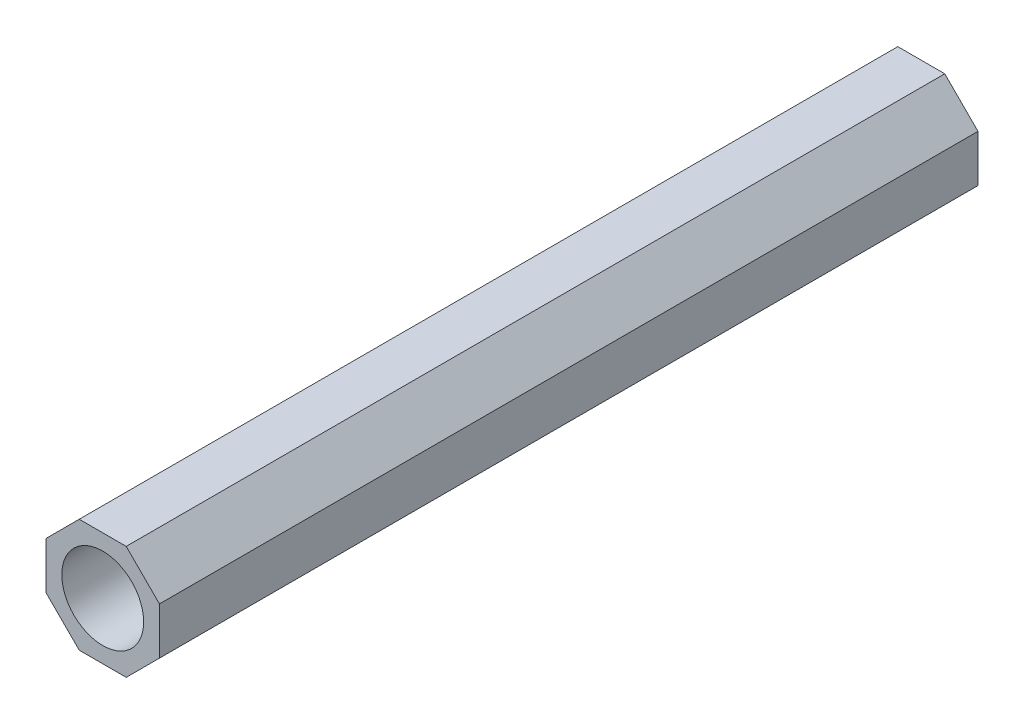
ISO-10303-21;
HEADER;
FILE_DESCRIPTION(('STEP AP214'),'2;1');
FILE_NAME('part.step','',(''),(''),'','','');
FILE_SCHEMA(('AUTOMOTIVE_DESIGN { 1 0 10303 214 1 1 1 1 }'));
ENDSEC;
DATA;
#1=APPLICATION_CONTEXT('core data for automotive mechanical design processes');
#2=APPLICATION_PROTOCOL_DEFINITION('international standard','automotive_design',2000,#1);
#3=PRODUCT_CONTEXT('',#1,'mechanical');
#4=PRODUCT('Part','Part','',(#3));
#5=PRODUCT_RELATED_PRODUCT_CATEGORY('part','',(#4));
#6=PRODUCT_DEFINITION_FORMATION('','',#4);
#7=PRODUCT_DEFINITION_CONTEXT('part definition',#1,'design');
#8=PRODUCT_DEFINITION('design','',#6,#7);
#9=PRODUCT_DEFINITION_SHAPE('','',#8);
#10=(LENGTH_UNIT() NAMED_UNIT(*) SI_UNIT(.MILLI.,.METRE.));
#11=(NAMED_UNIT(*) PLANE_ANGLE_UNIT() SI_UNIT($,.RADIAN.));
#12=(NAMED_UNIT(*) SI_UNIT($,.STERADIAN.) SOLID_ANGLE_UNIT());
#13=UNCERTAINTY_MEASURE_WITH_UNIT(LENGTH_MEASURE(1.E-05),#10,'distance_accuracy_value','');
#14=(GEOMETRIC_REPRESENTATION_CONTEXT(3) GLOBAL_UNCERTAINTY_ASSIGNED_CONTEXT((#13)) GLOBAL_UNIT_ASSIGNED_CONTEXT((#10,
#11,#12)) REPRESENTATION_CONTEXT('',''));
#15=CARTESIAN_POINT('',(0.,0.,0.));
#16=DIRECTION('',(0.,0.,1.));
#17=DIRECTION('',(1.,0.,0.));
#18=AXIS2_PLACEMENT_3D('',#15,#16,#17);
#19=CARTESIAN_POINT('',(-296.00004745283,3.6450596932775,127.));
#20=DIRECTION('',(-0.707106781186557,-0.707106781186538,0.));
#21=DIRECTION('',(0.707106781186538,-0.707106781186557,0.));
#22=AXIS2_PLACEMENT_3D('',#19,#20,#21);
#23=PLANE('',#22);
#24=DIRECTION('',(-0.707106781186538,0.707106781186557,0.));
#25=VECTOR('',#24,1.);
#26=CARTESIAN_POINT('',(-296.00004745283,3.6450596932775,0.));
#27=LINE('',#26,#25);
#28=CARTESIAN_POINT('',(-296.00004745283,3.6450596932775,0.));
#29=VERTEX_POINT('',#28);
#30=CARTESIAN_POINT('',(-301.154940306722,8.79995254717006,0.));
#31=VERTEX_POINT('',#30);
#32=EDGE_CURVE('E129',#29,#31,#27,.T.);
#33=ORIENTED_EDGE('',*,*,#32,.T.);
#34=DIRECTION('',(0.,0.,-1.));
#35=VECTOR('',#34,1.);
#36=CARTESIAN_POINT('',(-301.154940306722,8.79995254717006,127.));
#37=LINE('',#36,#35);
#38=CARTESIAN_POINT('',(-301.154940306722,8.79995254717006,127.));
#39=VERTEX_POINT('',#38);
#40=EDGE_CURVE('E11',#39,#31,#37,.T.);
#41=ORIENTED_EDGE('',*,*,#40,.F.);
#42=DIRECTION('',(-0.707106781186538,0.707106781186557,0.));
#43=VECTOR('',#42,1.);
#44=CARTESIAN_POINT('',(-296.00004745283,3.6450596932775,127.));
#45=LINE('',#44,#43);
#46=CARTESIAN_POINT('',(-296.00004745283,3.6450596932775,127.));
#47=VERTEX_POINT('',#46);
#48=EDGE_CURVE('E144',#47,#39,#45,.T.);
#49=ORIENTED_EDGE('',*,*,#48,.F.);
#50=DIRECTION('',(0.,0.,-1.));
#51=VECTOR('',#50,1.);
#52=CARTESIAN_POINT('',(-296.00004745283,3.6450596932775,127.));
#53=LINE('',#52,#51);
#54=EDGE_CURVE('E125',#47,#29,#53,.T.);
#55=ORIENTED_EDGE('',*,*,#54,.T.);
#56=EDGE_LOOP('',(#33,#41,#49,#55));
#57=FACE_BOUND('',#56,.T.);
#58=ADVANCED_FACE('F33',(#57),#23,.F.);
#59=CARTESIAN_POINT('',(-301.154940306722,8.79995254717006,127.));
#60=DIRECTION('',(0.,-1.,0.));
#61=DIRECTION('',(1.,0.,0.));
#62=AXIS2_PLACEMENT_3D('',#59,#60,#61);
#63=PLANE('',#62);
#64=DIRECTION('',(-1.,0.,0.));
#65=VECTOR('',#64,1.);
#66=CARTESIAN_POINT('',(-301.154940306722,8.79995254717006,0.));
#67=LINE('',#66,#65);
#68=CARTESIAN_POINT('',(-308.445059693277,8.79995254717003,0.));
#69=VERTEX_POINT('',#68);
#70=EDGE_CURVE('E132',#31,#69,#67,.T.);
#71=ORIENTED_EDGE('',*,*,#70,.T.);
#72=DIRECTION('',(0.,0.,-1.));
#73=VECTOR('',#72,1.);
#74=CARTESIAN_POINT('',(-308.445059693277,8.79995254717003,127.));
#75=LINE('',#74,#73);
#76=CARTESIAN_POINT('',(-308.445059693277,8.79995254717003,127.));
#77=VERTEX_POINT('',#76);
#78=EDGE_CURVE('E41',#77,#69,#75,.T.);
#79=ORIENTED_EDGE('',*,*,#78,.F.);
#80=DIRECTION('',(-1.,0.,0.));
#81=VECTOR('',#80,1.);
#82=CARTESIAN_POINT('',(-301.154940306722,8.79995254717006,127.));
#83=LINE('',#82,#81);
#84=EDGE_CURVE('E92',#39,#77,#83,.T.);
#85=ORIENTED_EDGE('',*,*,#84,.F.);
#86=ORIENTED_EDGE('',*,*,#40,.T.);
#87=EDGE_LOOP('',(#71,#79,#85,#86));
#88=FACE_BOUND('',#87,.T.);
#89=ADVANCED_FACE('F200',(#88),#63,.F.);
#90=CARTESIAN_POINT('',(-308.445059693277,8.79995254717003,127.));
#91=DIRECTION('',(0.707106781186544,-0.707106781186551,0.));
#92=DIRECTION('',(0.707106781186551,0.707106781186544,0.));
#93=AXIS2_PLACEMENT_3D('',#90,#91,#92);
#94=PLANE('',#93);
#95=DIRECTION('',(-0.707106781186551,-0.707106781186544,0.));
#96=VECTOR('',#95,1.);
#97=CARTESIAN_POINT('',(-308.445059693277,8.79995254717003,0.));
#98=LINE('',#97,#96);
#99=CARTESIAN_POINT('',(-313.59995254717,3.6450596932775,0.));
#100=VERTEX_POINT('',#99);
#101=EDGE_CURVE('E135',#69,#100,#98,.T.);
#102=ORIENTED_EDGE('',*,*,#101,.T.);
#103=DIRECTION('',(0.,0.,-1.));
#104=VECTOR('',#103,1.);
#105=CARTESIAN_POINT('',(-313.59995254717,3.6450596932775,127.));
#106=LINE('',#105,#104);
#107=CARTESIAN_POINT('',(-313.59995254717,3.6450596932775,127.));
#108=VERTEX_POINT('',#107);
#109=EDGE_CURVE('E151',#108,#100,#106,.T.);
#110=ORIENTED_EDGE('',*,*,#109,.F.);
#111=DIRECTION('',(-0.707106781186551,-0.707106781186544,0.));
#112=VECTOR('',#111,1.);
#113=CARTESIAN_POINT('',(-308.445059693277,8.79995254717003,127.));
#114=LINE('',#113,#112);
#115=EDGE_CURVE('E159',#77,#108,#114,.T.);
#116=ORIENTED_EDGE('',*,*,#115,.F.);
#117=ORIENTED_EDGE('',*,*,#78,.T.);
#118=EDGE_LOOP('',(#102,#110,#116,#117));
#119=FACE_BOUND('',#118,.T.);
#120=ADVANCED_FACE('F157',(#119),#94,.F.);
#121=CARTESIAN_POINT('',(-313.59995254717,3.6450596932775,127.));
#122=DIRECTION('',(1.,0.,0.));
#123=DIRECTION('',(0.,0.,-1.));
#124=AXIS2_PLACEMENT_3D('',#121,#122,#123);
#125=PLANE('',#124);
#126=DIRECTION('',(0.,-1.,0.));
#127=VECTOR('',#126,1.);
#128=CARTESIAN_POINT('',(-313.59995254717,3.6450596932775,0.));
#129=LINE('',#128,#127);
#130=CARTESIAN_POINT('',(-313.59995254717,-3.64505969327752,0.));
#131=VERTEX_POINT('',#130);
#132=EDGE_CURVE('E137',#100,#131,#129,.T.);
#133=ORIENTED_EDGE('',*,*,#132,.T.);
#134=DIRECTION('',(0.,0.,-1.));
#135=VECTOR('',#134,1.);
#136=CARTESIAN_POINT('',(-313.59995254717,-3.64505969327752,127.));
#137=LINE('',#136,#135);
#138=CARTESIAN_POINT('',(-313.59995254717,-3.64505969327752,127.));
#139=VERTEX_POINT('',#138);
#140=EDGE_CURVE('E148',#139,#131,#137,.T.);
#141=ORIENTED_EDGE('',*,*,#140,.F.);
#142=DIRECTION('',(0.,-1.,0.));
#143=VECTOR('',#142,1.);
#144=CARTESIAN_POINT('',(-313.59995254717,3.6450596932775,127.));
#145=LINE('',#144,#143);
#146=EDGE_CURVE('E171',#108,#139,#145,.T.);
#147=ORIENTED_EDGE('',*,*,#146,.F.);
#148=ORIENTED_EDGE('',*,*,#109,.T.);
#149=EDGE_LOOP('',(#133,#141,#147,#148));
#150=FACE_BOUND('',#149,.T.);
#151=ADVANCED_FACE('F167',(#150),#125,.F.);
#152=CARTESIAN_POINT('',(-313.59995254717,-3.64505969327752,127.));
#153=DIRECTION('',(0.707106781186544,0.707106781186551,0.));
#154=DIRECTION('',(-0.707106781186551,0.707106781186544,0.));
#155=AXIS2_PLACEMENT_3D('',#152,#153,#154);
#156=PLANE('',#155);
#157=DIRECTION('',(0.707106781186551,-0.707106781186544,0.));
#158=VECTOR('',#157,1.);
#159=CARTESIAN_POINT('',(-313.59995254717,-3.64505969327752,0.));
#160=LINE('',#159,#158);
#161=CARTESIAN_POINT('',(-308.445059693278,-8.79995254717,0.));
#162=VERTEX_POINT('',#161);
#163=EDGE_CURVE('E139',#131,#162,#160,.T.);
#164=ORIENTED_EDGE('',*,*,#163,.T.);
#165=DIRECTION('',(0.,0.,-1.));
#166=VECTOR('',#165,1.);
#167=CARTESIAN_POINT('',(-308.445059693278,-8.79995254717,127.));
#168=LINE('',#167,#166);
#169=CARTESIAN_POINT('',(-308.445059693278,-8.79995254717,127.));
#170=VERTEX_POINT('',#169);
#171=EDGE_CURVE('E120',#170,#162,#168,.T.);
#172=ORIENTED_EDGE('',*,*,#171,.F.);
#173=DIRECTION('',(0.707106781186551,-0.707106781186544,0.));
#174=VECTOR('',#173,1.);
#175=CARTESIAN_POINT('',(-313.59995254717,-3.64505969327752,127.));
#176=LINE('',#175,#174);
#177=EDGE_CURVE('E111',#139,#170,#176,.T.);
#178=ORIENTED_EDGE('',*,*,#177,.F.);
#179=ORIENTED_EDGE('',*,*,#140,.T.);
#180=EDGE_LOOP('',(#164,#172,#178,#179));
#181=FACE_BOUND('',#180,.T.);
#182=ADVANCED_FACE('F170',(#181),#156,.F.);
#183=CARTESIAN_POINT('',(-308.445059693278,-8.79995254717,127.));
#184=DIRECTION('',(0.,1.,0.));
#185=DIRECTION('',(-1.,0.,0.));
#186=AXIS2_PLACEMENT_3D('',#183,#184,#185);
#187=PLANE('',#186);
#188=DIRECTION('',(1.,0.,0.));
#189=VECTOR('',#188,1.);
#190=CARTESIAN_POINT('',(-308.445059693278,-8.79995254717,0.));
#191=LINE('',#190,#189);
#192=CARTESIAN_POINT('',(-301.154940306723,-8.79995254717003,0.));
#193=VERTEX_POINT('',#192);
#194=EDGE_CURVE('E119',#162,#193,#191,.T.);
#195=ORIENTED_EDGE('',*,*,#194,.T.);
#196=DIRECTION('',(0.,0.,-1.));
#197=VECTOR('',#196,1.);
#198=CARTESIAN_POINT('',(-301.154940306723,-8.79995254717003,127.));
#199=LINE('',#198,#197);
#200=CARTESIAN_POINT('',(-301.154940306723,-8.79995254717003,127.));
#201=VERTEX_POINT('',#200);
#202=EDGE_CURVE('E116',#201,#193,#199,.T.);
#203=ORIENTED_EDGE('',*,*,#202,.F.);
#204=DIRECTION('',(1.,0.,0.));
#205=VECTOR('',#204,1.);
#206=CARTESIAN_POINT('',(-308.445059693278,-8.79995254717,127.));
#207=LINE('',#206,#205);
#208=EDGE_CURVE('E105',#170,#201,#207,.T.);
#209=ORIENTED_EDGE('',*,*,#208,.F.);
#210=ORIENTED_EDGE('',*,*,#171,.T.);
#211=EDGE_LOOP('',(#195,#203,#209,#210));
#212=FACE_BOUND('',#211,.T.);
#213=ADVANCED_FACE('F117',(#212),#187,.F.);
#214=CARTESIAN_POINT('',(-301.154940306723,-8.79995254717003,127.));
#215=DIRECTION('',(-0.707106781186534,0.707106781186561,0.));
#216=DIRECTION('',(-0.707106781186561,-0.707106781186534,0.));
#217=AXIS2_PLACEMENT_3D('',#214,#215,#216);
#218=PLANE('',#217);
#219=DIRECTION('',(0.707106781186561,0.707106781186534,0.));
#220=VECTOR('',#219,1.);
#221=CARTESIAN_POINT('',(-301.154940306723,-8.79995254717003,0.));
#222=LINE('',#221,#220);
#223=CARTESIAN_POINT('',(-296.00004745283,-3.64505969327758,0.));
#224=VERTEX_POINT('',#223);
#225=EDGE_CURVE('E78',#193,#224,#222,.T.);
#226=ORIENTED_EDGE('',*,*,#225,.T.);
#227=DIRECTION('',(0.,0.,-1.));
#228=VECTOR('',#227,1.);
#229=CARTESIAN_POINT('',(-296.00004745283,-3.64505969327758,127.));
#230=LINE('',#229,#228);
#231=CARTESIAN_POINT('',(-296.00004745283,-3.64505969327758,127.));
#232=VERTEX_POINT('',#231);
#233=EDGE_CURVE('E121',#232,#224,#230,.T.);
#234=ORIENTED_EDGE('',*,*,#233,.F.);
#235=DIRECTION('',(0.707106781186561,0.707106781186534,0.));
#236=VECTOR('',#235,1.);
#237=CARTESIAN_POINT('',(-301.154940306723,-8.79995254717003,127.));
#238=LINE('',#237,#236);
#239=EDGE_CURVE('E109',#201,#232,#238,.T.);
#240=ORIENTED_EDGE('',*,*,#239,.F.);
#241=ORIENTED_EDGE('',*,*,#202,.T.);
#242=EDGE_LOOP('',(#226,#234,#240,#241));
#243=FACE_BOUND('',#242,.T.);
#244=ADVANCED_FACE('F123',(#243),#218,.F.);
#245=CARTESIAN_POINT('',(-296.00004745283,-3.64505969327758,127.));
#246=DIRECTION('',(-1.,0.,0.));
#247=DIRECTION('',(0.,-1.,0.));
#248=AXIS2_PLACEMENT_3D('',#245,#246,#247);
#249=PLANE('',#248);
#250=DIRECTION('',(0.,1.,0.));
#251=VECTOR('',#250,1.);
#252=CARTESIAN_POINT('',(-296.00004745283,-3.64505969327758,0.));
#253=LINE('',#252,#251);
#254=EDGE_CURVE('E84',#224,#29,#253,.T.);
#255=ORIENTED_EDGE('',*,*,#254,.T.);
#256=ORIENTED_EDGE('',*,*,#54,.F.);
#257=DIRECTION('',(0.,1.,0.));
#258=VECTOR('',#257,1.);
#259=CARTESIAN_POINT('',(-296.00004745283,-3.64505969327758,127.));
#260=LINE('',#259,#258);
#261=EDGE_CURVE('E49',#232,#47,#260,.T.);
#262=ORIENTED_EDGE('',*,*,#261,.F.);
#263=ORIENTED_EDGE('',*,*,#233,.T.);
#264=EDGE_LOOP('',(#255,#256,#262,#263));
#265=FACE_BOUND('',#264,.T.);
#266=ADVANCED_FACE('F191',(#265),#249,.F.);
#267=CARTESIAN_POINT('',(-292.354987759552,-1.17961196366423E-13,127.));
#268=DIRECTION('',(0.,0.,-1.));
#269=DIRECTION('',(-1.,0.,0.));
#270=AXIS2_PLACEMENT_3D('',#267,#268,#269);
#271=PLANE('',#270);
#272=CARTESIAN_POINT('',(-304.8,0.,127.));
#273=DIRECTION('',(0.,0.,1.));
#274=DIRECTION('',(1.,0.,0.));
#275=AXIS2_PLACEMENT_3D('',#272,#273,#274);
#276=CIRCLE('',#275,6.35);
#277=CARTESIAN_POINT('',(-298.45,0.,127.));
#278=VERTEX_POINT('',#277);
#279=EDGE_CURVE('E177',#278,#278,#276,.T.);
#280=ORIENTED_EDGE('',*,*,#279,.F.);
#281=EDGE_LOOP('',(#280));
#282=FACE_BOUND('',#281,.T.);
#283=ORIENTED_EDGE('',*,*,#48,.T.);
#284=ORIENTED_EDGE('',*,*,#84,.T.);
#285=ORIENTED_EDGE('',*,*,#115,.T.);
#286=ORIENTED_EDGE('',*,*,#146,.T.);
#287=ORIENTED_EDGE('',*,*,#177,.T.);
#288=ORIENTED_EDGE('',*,*,#208,.T.);
#289=ORIENTED_EDGE('',*,*,#239,.T.);
#290=ORIENTED_EDGE('',*,*,#261,.T.);
#291=EDGE_LOOP('',(#283,#284,#285,#286,#287,#288,#289,#290));
#292=FACE_BOUND('',#291,.T.);
#293=ADVANCED_FACE('F107',(#282,#292),#271,.F.);
#294=CARTESIAN_POINT('',(-292.354987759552,-1.17961196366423E-13,0.));
#295=DIRECTION('',(0.,0.,-1.));
#296=DIRECTION('',(-1.,0.,0.));
#297=AXIS2_PLACEMENT_3D('',#294,#295,#296);
#298=PLANE('',#297);
#299=CARTESIAN_POINT('',(-304.8,0.,0.));
#300=DIRECTION('',(0.,0.,1.));
#301=DIRECTION('',(1.,0.,0.));
#302=AXIS2_PLACEMENT_3D('',#299,#300,#301);
#303=CIRCLE('',#302,6.35);
#304=CARTESIAN_POINT('',(-298.45,0.,0.));
#305=VERTEX_POINT('',#304);
#306=EDGE_CURVE('E133',#305,#305,#303,.T.);
#307=ORIENTED_EDGE('',*,*,#306,.T.);
#308=EDGE_LOOP('',(#307));
#309=FACE_BOUND('',#308,.T.);
#310=ORIENTED_EDGE('',*,*,#32,.F.);
#311=ORIENTED_EDGE('',*,*,#254,.F.);
#312=ORIENTED_EDGE('',*,*,#225,.F.);
#313=ORIENTED_EDGE('',*,*,#194,.F.);
#314=ORIENTED_EDGE('',*,*,#163,.F.);
#315=ORIENTED_EDGE('',*,*,#132,.F.);
#316=ORIENTED_EDGE('',*,*,#101,.F.);
#317=ORIENTED_EDGE('',*,*,#70,.F.);
#318=EDGE_LOOP('',(#310,#311,#312,#313,#314,#315,#316,#317));
#319=FACE_BOUND('',#318,.T.);
#320=ADVANCED_FACE('F163',(#309,#319),#298,.T.);
#321=CARTESIAN_POINT('',(-304.8,0.,0.));
#322=DIRECTION('',(0.,0.,1.));
#323=DIRECTION('',(1.,0.,0.));
#324=AXIS2_PLACEMENT_3D('',#321,#322,#323);
#325=CYLINDRICAL_SURFACE('',#324,6.35);
#326=ORIENTED_EDGE('',*,*,#306,.F.);
#327=EDGE_LOOP('',(#326));
#328=FACE_BOUND('',#327,.T.);
#329=ORIENTED_EDGE('',*,*,#279,.T.);
#330=EDGE_LOOP('',(#329));
#331=FACE_BOUND('',#330,.T.);
#332=ADVANCED_FACE('F184',(#328,#331),#325,.F.);
#333=CLOSED_SHELL('',(#58,#89,#120,#151,#182,#213,#244,#266,#293,#320,#332));
#334=MANIFOLD_SOLID_BREP('B2',#333);
#335=ADVANCED_BREP_SHAPE_REPRESENTATION('',(#18,#334),#14);
#336=SHAPE_DEFINITION_REPRESENTATION(#9,#335);
ENDSEC;
END-ISO-10303-21;
